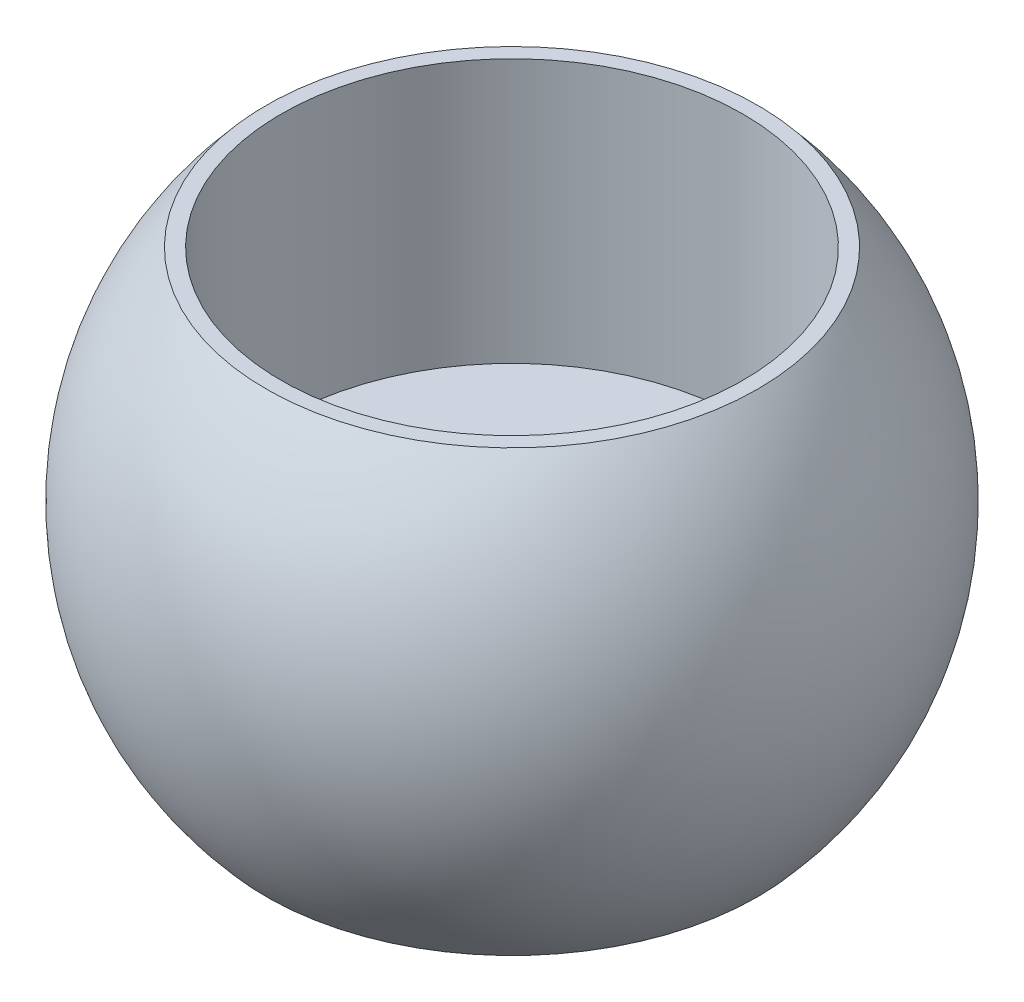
ISO-10303-21;
HEADER;
FILE_DESCRIPTION(('STEP AP214'),'2;1');
FILE_NAME('part.step','',(''),(''),'','','');
FILE_SCHEMA(('AUTOMOTIVE_DESIGN { 1 0 10303 214 1 1 1 1 }'));
ENDSEC;
DATA;
#1=APPLICATION_CONTEXT('core data for automotive mechanical design processes');
#2=APPLICATION_PROTOCOL_DEFINITION('international standard','automotive_design',2000,#1);
#3=PRODUCT_CONTEXT('',#1,'mechanical');
#4=PRODUCT('Part','Part','',(#3));
#5=PRODUCT_RELATED_PRODUCT_CATEGORY('part','',(#4));
#6=PRODUCT_DEFINITION_FORMATION('','',#4);
#7=PRODUCT_DEFINITION_CONTEXT('part definition',#1,'design');
#8=PRODUCT_DEFINITION('design','',#6,#7);
#9=PRODUCT_DEFINITION_SHAPE('','',#8);
#10=(LENGTH_UNIT() NAMED_UNIT(*) SI_UNIT(.MILLI.,.METRE.));
#11=(NAMED_UNIT(*) PLANE_ANGLE_UNIT() SI_UNIT($,.RADIAN.));
#12=(NAMED_UNIT(*) SI_UNIT($,.STERADIAN.) SOLID_ANGLE_UNIT());
#13=UNCERTAINTY_MEASURE_WITH_UNIT(LENGTH_MEASURE(1.E-05),#10,'distance_accuracy_value','');
#14=(GEOMETRIC_REPRESENTATION_CONTEXT(3) GLOBAL_UNCERTAINTY_ASSIGNED_CONTEXT((#13)) GLOBAL_UNIT_ASSIGNED_CONTEXT((#10,
#11,#12)) REPRESENTATION_CONTEXT('',''));
#15=CARTESIAN_POINT('',(0.,0.,0.));
#16=DIRECTION('',(0.,0.,1.));
#17=DIRECTION('',(1.,0.,0.));
#18=AXIS2_PLACEMENT_3D('',#15,#16,#17);
#19=CARTESIAN_POINT('',(0.,-5.,0.));
#20=DIRECTION('',(0.,-1.,0.));
#21=DIRECTION('',(0.,0.,-1.));
#22=AXIS2_PLACEMENT_3D('',#19,#20,#21);
#23=CONICAL_SURFACE('',#22,5.5,0.832981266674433);
#24=CARTESIAN_POINT('',(0.,-9.99999999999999,0.));
#25=DIRECTION('',(0.,-1.,0.));
#26=DIRECTION('',(0.,0.,-1.));
#27=AXIS2_PLACEMENT_3D('',#24,#25,#26);
#28=CIRCLE('',#27,11.);
#29=CARTESIAN_POINT('',(0.,-9.99999999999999,-11.));
#30=VERTEX_POINT('',#29);
#31=EDGE_CURVE('E10',#30,#30,#28,.T.);
#32=ORIENTED_EDGE('',*,*,#31,.T.);
#33=EDGE_LOOP('',(#32));
#34=FACE_BOUND('',#33,.T.);
#35=CARTESIAN_POINT('',(0.,-5.,0.));
#36=DIRECTION('',(0.,-1.,0.));
#37=DIRECTION('',(0.,0.,-1.));
#38=AXIS2_PLACEMENT_3D('',#35,#36,#37);
#39=CIRCLE('',#38,5.5);
#40=CARTESIAN_POINT('',(0.,-5.,-5.5));
#41=VERTEX_POINT('',#40);
#42=EDGE_CURVE('E56',#41,#41,#39,.T.);
#43=ORIENTED_EDGE('',*,*,#42,.F.);
#44=EDGE_LOOP('',(#43));
#45=FACE_BOUND('',#44,.T.);
#46=ADVANCED_FACE('F31',(#34,#45),#23,.F.);
#47=CARTESIAN_POINT('',(11.,-10.,0.));
#48=DIRECTION('',(0.,-1.,0.));
#49=DIRECTION('',(0.,0.,-1.));
#50=AXIS2_PLACEMENT_3D('',#47,#48,#49);
#51=PLANE('',#50);
#52=CARTESIAN_POINT('',(0.,-9.99999999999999,0.));
#53=DIRECTION('',(0.,-1.,0.));
#54=DIRECTION('',(0.,0.,-1.));
#55=AXIS2_PLACEMENT_3D('',#52,#53,#54);
#56=CIRCLE('',#55,11.1803398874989);
#57=CARTESIAN_POINT('',(11.180339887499,-9.99999999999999,0.));
#58=VERTEX_POINT('',#57);
#59=EDGE_CURVE('E37',#58,#58,#56,.T.);
#60=ORIENTED_EDGE('',*,*,#59,.T.);
#61=EDGE_LOOP('',(#60));
#62=FACE_BOUND('',#61,.T.);
#63=ORIENTED_EDGE('',*,*,#31,.F.);
#64=EDGE_LOOP('',(#63));
#65=FACE_BOUND('',#64,.T.);
#66=ADVANCED_FACE('F64',(#62,#65),#51,.T.);
#67=CARTESIAN_POINT('',(0.,0.,0.));
#68=DIRECTION('',(0.,-1.,0.));
#69=DIRECTION('',(1.,0.,0.));
#70=AXIS2_PLACEMENT_3D('',#67,#68,#69);
#71=SPHERICAL_SURFACE('',#70,15.);
#72=CARTESIAN_POINT('',(0.,9.99999999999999,0.));
#73=DIRECTION('',(0.,-1.,0.));
#74=DIRECTION('',(0.,0.,-1.));
#75=AXIS2_PLACEMENT_3D('',#72,#73,#74);
#76=CIRCLE('',#75,11.1803398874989);
#77=CARTESIAN_POINT('',(11.180339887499,10.,0.));
#78=VERTEX_POINT('',#77);
#79=EDGE_CURVE('E41',#78,#78,#76,.T.);
#80=CARTESIAN_POINT('',(11.180339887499,10.,0.));
#81=CARTESIAN_POINT('',(11.3323694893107,9.83003155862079,0.));
#82=CARTESIAN_POINT('',(11.4805171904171,9.65659145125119,0.));
#83=CARTESIAN_POINT('',(11.7687539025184,9.30313939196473,0.));
#84=CARTESIAN_POINT('',(11.9088429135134,9.12312744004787,0.));
#85=CARTESIAN_POINT('',(12.1806673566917,8.75690317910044,0.));
#86=CARTESIAN_POINT('',(12.3124027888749,8.57069087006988,0.));
#87=CARTESIAN_POINT('',(12.5672470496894,8.19245393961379,0.));
#88=CARTESIAN_POINT('',(12.6903558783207,8.00042931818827,0.));
#89=CARTESIAN_POINT('',(12.9276906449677,7.61096691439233,0.));
#90=CARTESIAN_POINT('',(13.0419165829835,7.41352913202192,0.));
#91=CARTESIAN_POINT('',(13.2612480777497,7.01365107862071,0.));
#92=CARTESIAN_POINT('',(13.3663536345,6.81121080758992,0.));
#93=CARTESIAN_POINT('',(13.5672257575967,6.40174878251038,0.));
#94=CARTESIAN_POINT('',(13.6629923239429,6.19472702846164,0.));
#95=CARTESIAN_POINT('',(13.8449873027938,5.77653259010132,0.));
#96=CARTESIAN_POINT('',(13.9312157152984,5.56535990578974,0.));
#97=CARTESIAN_POINT('',(14.0939550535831,5.13930278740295,0.));
#98=CARTESIAN_POINT('',(14.1704659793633,4.92441835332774,0.));
#99=CARTESIAN_POINT('',(14.3136112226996,4.49138463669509,0.));
#100=CARTESIAN_POINT('',(14.3802455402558,4.27323535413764,0.));
#101=CARTESIAN_POINT('',(14.5034989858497,3.83412563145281,0.));
#102=CARTESIAN_POINT('',(14.5601181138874,3.61316519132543,0.));
#103=CARTESIAN_POINT('',(14.6632234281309,3.16889269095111,0.));
#104=CARTESIAN_POINT('',(14.7097096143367,2.94558063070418,0.));
#105=CARTESIAN_POINT('',(14.7924523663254,2.4970693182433,0.));
#106=CARTESIAN_POINT('',(14.8287089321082,2.27187006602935,0.));
#107=CARTESIAN_POINT('',(14.8909170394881,1.8200527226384,0.));
#108=CARTESIAN_POINT('',(14.916868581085,1.59343463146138,0.));
#109=CARTESIAN_POINT('',(14.9584126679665,1.13925091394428,0.));
#110=CARTESIAN_POINT('',(14.974005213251,0.911685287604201,0.));
#111=CARTESIAN_POINT('',(14.9947988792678,0.456079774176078,0.));
#112=CARTESIAN_POINT('',(15.,0.22803988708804,0.));
#113=CARTESIAN_POINT('',(15.,-0.228039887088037,0.));
#114=CARTESIAN_POINT('',(14.9947988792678,-0.456079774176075,0.));
#115=CARTESIAN_POINT('',(14.974005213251,-0.911685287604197,0.));
#116=CARTESIAN_POINT('',(14.9584126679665,-1.13925091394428,0.));
#117=CARTESIAN_POINT('',(14.916868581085,-1.59343463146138,0.));
#118=CARTESIAN_POINT('',(14.8909170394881,-1.82005272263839,0.));
#119=CARTESIAN_POINT('',(14.8287089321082,-2.27187006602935,0.));
#120=CARTESIAN_POINT('',(14.7924523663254,-2.49706931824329,0.));
#121=CARTESIAN_POINT('',(14.7097096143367,-2.94558063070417,0.));
#122=CARTESIAN_POINT('',(14.6632234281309,-3.16889269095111,0.));
#123=CARTESIAN_POINT('',(14.5601181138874,-3.61316519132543,0.));
#124=CARTESIAN_POINT('',(14.5034989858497,-3.83412563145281,0.));
#125=CARTESIAN_POINT('',(14.3802455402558,-4.27323535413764,0.));
#126=CARTESIAN_POINT('',(14.3136112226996,-4.49138463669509,0.));
#127=CARTESIAN_POINT('',(14.1704659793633,-4.92441835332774,0.));
#128=CARTESIAN_POINT('',(14.0939550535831,-5.13930278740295,0.));
#129=CARTESIAN_POINT('',(13.9312157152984,-5.56535990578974,0.));
#130=CARTESIAN_POINT('',(13.8449873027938,-5.77653259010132,0.));
#131=CARTESIAN_POINT('',(13.662992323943,-6.19472702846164,0.));
#132=CARTESIAN_POINT('',(13.5672257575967,-6.40174878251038,0.));
#133=CARTESIAN_POINT('',(13.3663536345,-6.81121080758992,0.));
#134=CARTESIAN_POINT('',(13.2612480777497,-7.01365107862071,0.));
#135=CARTESIAN_POINT('',(13.0419165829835,-7.41352913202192,0.));
#136=CARTESIAN_POINT('',(12.9276906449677,-7.61096691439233,0.));
#137=CARTESIAN_POINT('',(12.6903558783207,-8.00042931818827,0.));
#138=CARTESIAN_POINT('',(12.5672470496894,-8.19245393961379,0.));
#139=CARTESIAN_POINT('',(12.3124027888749,-8.57069087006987,0.));
#140=CARTESIAN_POINT('',(12.1806673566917,-8.75690317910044,0.));
#141=CARTESIAN_POINT('',(11.9088429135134,-9.12312744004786,0.));
#142=CARTESIAN_POINT('',(11.7687539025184,-9.30313939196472,0.));
#143=CARTESIAN_POINT('',(11.4805171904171,-9.65659145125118,0.));
#144=CARTESIAN_POINT('',(11.3323694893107,-9.83003155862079,0.));
#145=CARTESIAN_POINT('',(11.180339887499,-9.99999999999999,0.));
#146=B_SPLINE_CURVE_WITH_KNOTS('',3,(#80,#81,#82,#83,#84,#85,#86,#87,#88,#89,#90,#91,#92,#93,
#94,#95,#96,#97,#98,#99,#100,#101,#102,#103,#104,#105,#106,#107,#108,#109,#110,#111,#112,#113,
#114,#115,#116,#117,#118,#119,#120,#121,#122,#123,#124,#125,#126,#127,#128,#129,#130,#131,#132,
#133,#134,#135,#136,#137,#138,#139,#140,#141,#142,#143,#144,#145),.UNSPECIFIED.,.F.,.F.,(4,2,2,
2,2,2,2,2,2,2,2,2,2,2,2,2,2,2,2,2,2,2,2,2,2,2,2,2,2,2,2,2,4),(0.,0.684060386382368,
1.36812077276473,2.0521811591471,2.73624154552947,3.42030193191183,4.1043623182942,
4.78842270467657,5.47248309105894,6.1565434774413,6.84060386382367,7.52466425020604,
8.20872463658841,8.89278502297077,9.57684540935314,10.2609057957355,10.9449661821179,
11.6290265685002,12.3130869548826,12.997147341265,13.6812077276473,14.3652681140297,
15.0493285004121,15.7333888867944,16.4174492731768,17.1015096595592,17.7855700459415,
18.4696304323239,19.1536908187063,19.8377512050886,20.521811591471,21.2058719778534,
21.8899323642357),.UNSPECIFIED.);
#147=EDGE_CURVE('BSEAM68',#78,#58,#146,.T.);
#148=ORIENTED_EDGE('',*,*,#79,.T.);
#149=ORIENTED_EDGE('',*,*,#59,.F.);
#150=ORIENTED_EDGE('',*,*,#147,.T.);
#151=ORIENTED_EDGE('',*,*,#147,.F.);
#152=EDGE_LOOP('',(#148,#150,#149,#151));
#153=FACE_BOUND('',#152,.T.);
#154=ADVANCED_FACE('F68',(#153),#71,.T.);
#155=CARTESIAN_POINT('',(10.5,10.,0.));
#156=DIRECTION('',(0.,1.,0.));
#157=DIRECTION('',(0.,0.,1.));
#158=AXIS2_PLACEMENT_3D('',#155,#156,#157);
#159=PLANE('',#158);
#160=CARTESIAN_POINT('',(0.,9.99999999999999,0.));
#161=DIRECTION('',(0.,-1.,0.));
#162=DIRECTION('',(0.,0.,-1.));
#163=AXIS2_PLACEMENT_3D('',#160,#161,#162);
#164=CIRCLE('',#163,10.5);
#165=CARTESIAN_POINT('',(0.,9.99999999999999,-10.5));
#166=VERTEX_POINT('',#165);
#167=EDGE_CURVE('E45',#166,#166,#164,.T.);
#168=ORIENTED_EDGE('',*,*,#167,.T.);
#169=EDGE_LOOP('',(#168));
#170=FACE_BOUND('',#169,.T.);
#171=ORIENTED_EDGE('',*,*,#79,.F.);
#172=EDGE_LOOP('',(#171));
#173=FACE_BOUND('',#172,.T.);
#174=ADVANCED_FACE('F72',(#170,#173),#159,.T.);
#175=CARTESIAN_POINT('',(0.,-86.,0.));
#176=DIRECTION('',(0.,-1.,0.));
#177=DIRECTION('',(0.,0.,-1.));
#178=AXIS2_PLACEMENT_3D('',#175,#176,#177);
#179=CYLINDRICAL_SURFACE('',#178,10.5);
#180=CARTESIAN_POINT('',(0.,-2.,0.));
#181=DIRECTION('',(0.,-1.,0.));
#182=DIRECTION('',(0.,0.,-1.));
#183=AXIS2_PLACEMENT_3D('',#180,#181,#182);
#184=CIRCLE('',#183,10.5);
#185=CARTESIAN_POINT('',(0.,-2.,-10.5));
#186=VERTEX_POINT('',#185);
#187=EDGE_CURVE('E50',#186,#186,#184,.T.);
#188=ORIENTED_EDGE('',*,*,#187,.T.);
#189=EDGE_LOOP('',(#188));
#190=FACE_BOUND('',#189,.T.);
#191=ORIENTED_EDGE('',*,*,#167,.F.);
#192=EDGE_LOOP('',(#191));
#193=FACE_BOUND('',#192,.T.);
#194=ADVANCED_FACE('F79',(#190,#193),#179,.F.);
#195=CARTESIAN_POINT('',(5.5,-2.,0.));
#196=DIRECTION('',(0.,1.,0.));
#197=DIRECTION('',(0.,0.,1.));
#198=AXIS2_PLACEMENT_3D('',#195,#196,#197);
#199=PLANE('',#198);
#200=CARTESIAN_POINT('',(0.,-2.,0.));
#201=DIRECTION('',(0.,-1.,0.));
#202=DIRECTION('',(0.,0.,-1.));
#203=AXIS2_PLACEMENT_3D('',#200,#201,#202);
#204=CIRCLE('',#203,5.5);
#205=CARTESIAN_POINT('',(0.,-2.,-5.5));
#206=VERTEX_POINT('',#205);
#207=EDGE_CURVE('E53',#206,#206,#204,.T.);
#208=ORIENTED_EDGE('',*,*,#207,.T.);
#209=EDGE_LOOP('',(#208));
#210=FACE_BOUND('',#209,.T.);
#211=ORIENTED_EDGE('',*,*,#187,.F.);
#212=EDGE_LOOP('',(#211));
#213=FACE_BOUND('',#212,.T.);
#214=ADVANCED_FACE('F83',(#210,#213),#199,.T.);
#215=CARTESIAN_POINT('',(0.,-86.,0.));
#216=DIRECTION('',(0.,-1.,0.));
#217=DIRECTION('',(0.,0.,-1.));
#218=AXIS2_PLACEMENT_3D('',#215,#216,#217);
#219=CYLINDRICAL_SURFACE('',#218,5.5);
#220=ORIENTED_EDGE('',*,*,#42,.T.);
#221=EDGE_LOOP('',(#220));
#222=FACE_BOUND('',#221,.T.);
#223=ORIENTED_EDGE('',*,*,#207,.F.);
#224=EDGE_LOOP('',(#223));
#225=FACE_BOUND('',#224,.T.);
#226=ADVANCED_FACE('F60',(#222,#225),#219,.F.);
#227=CLOSED_SHELL('',(#46,#66,#154,#174,#194,#214,#226));
#228=MANIFOLD_SOLID_BREP('B2',#227);
#229=ADVANCED_BREP_SHAPE_REPRESENTATION('',(#18,#228),#14);
#230=SHAPE_DEFINITION_REPRESENTATION(#9,#229);
ENDSEC;
END-ISO-10303-21;
